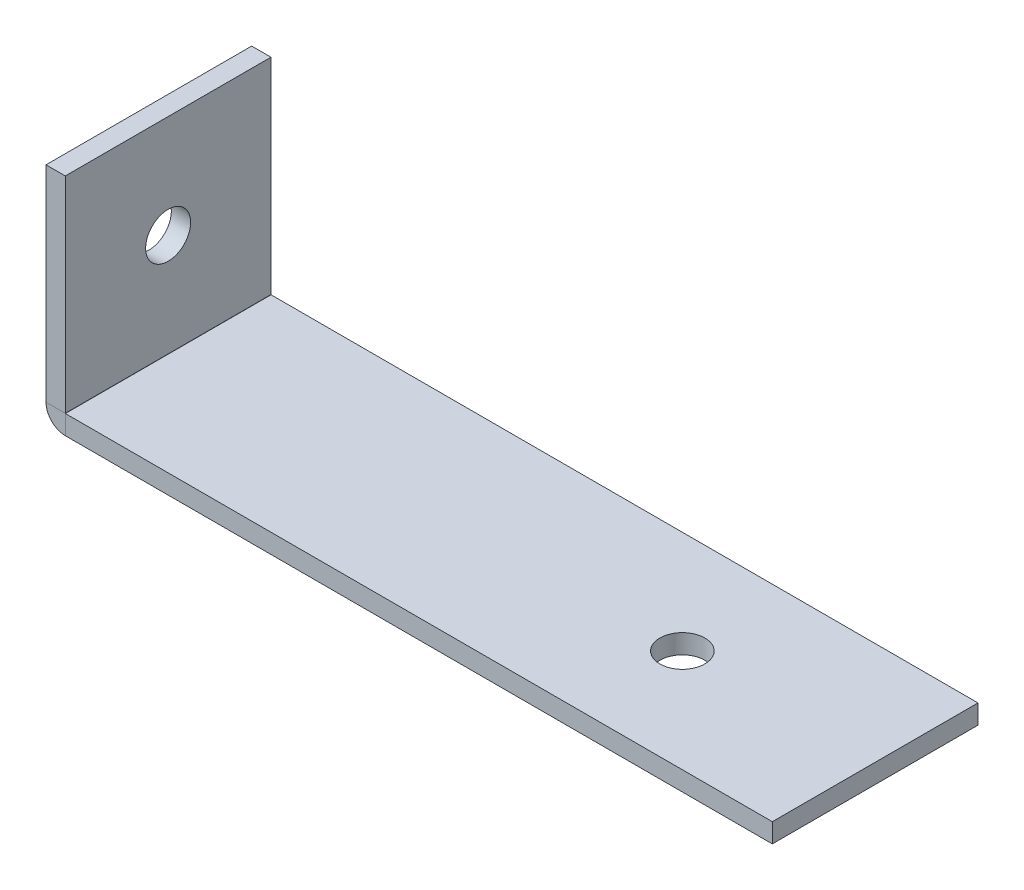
ISO-10303-21;
HEADER;
FILE_DESCRIPTION(('STEP AP214'),'2;1');
FILE_NAME('part.step','',(''),(''),'','','');
FILE_SCHEMA(('AUTOMOTIVE_DESIGN { 1 0 10303 214 1 1 1 1 }'));
ENDSEC;
DATA;
#1=APPLICATION_CONTEXT('core data for automotive mechanical design processes');
#2=APPLICATION_PROTOCOL_DEFINITION('international standard','automotive_design',2000,#1);
#3=PRODUCT_CONTEXT('',#1,'mechanical');
#4=PRODUCT('Part','Part','',(#3));
#5=PRODUCT_RELATED_PRODUCT_CATEGORY('part','',(#4));
#6=PRODUCT_DEFINITION_FORMATION('','',#4);
#7=PRODUCT_DEFINITION_CONTEXT('part definition',#1,'design');
#8=PRODUCT_DEFINITION('design','',#6,#7);
#9=PRODUCT_DEFINITION_SHAPE('','',#8);
#10=(LENGTH_UNIT() NAMED_UNIT(*) SI_UNIT(.MILLI.,.METRE.));
#11=(NAMED_UNIT(*) PLANE_ANGLE_UNIT() SI_UNIT($,.RADIAN.));
#12=(NAMED_UNIT(*) SI_UNIT($,.STERADIAN.) SOLID_ANGLE_UNIT());
#13=UNCERTAINTY_MEASURE_WITH_UNIT(LENGTH_MEASURE(1.E-05),#10,'distance_accuracy_value','');
#14=(GEOMETRIC_REPRESENTATION_CONTEXT(3) GLOBAL_UNCERTAINTY_ASSIGNED_CONTEXT((#13)) GLOBAL_UNIT_ASSIGNED_CONTEXT((#10,
#11,#12)) REPRESENTATION_CONTEXT('',''));
#15=CARTESIAN_POINT('',(0.,0.,0.));
#16=DIRECTION('',(0.,0.,1.));
#17=DIRECTION('',(1.,0.,0.));
#18=AXIS2_PLACEMENT_3D('',#15,#16,#17);
#19=CARTESIAN_POINT('',(14.4978657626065,17.5021342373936,-16.));
#20=DIRECTION('',(-1.,0.,0.));
#21=DIRECTION('',(0.,0.,-1.));
#22=AXIS2_PLACEMENT_3D('',#19,#20,#21);
#23=PLANE('',#22);
#24=CARTESIAN_POINT('',(14.4978657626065,9.50213423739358,-7.99999999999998));
#25=DIRECTION('',(1.,0.,0.));
#26=DIRECTION('',(0.,0.,1.));
#27=AXIS2_PLACEMENT_3D('',#24,#25,#26);
#28=CIRCLE('',#27,1.75);
#29=CARTESIAN_POINT('',(14.4978657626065,9.50213423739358,-6.24999999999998));
#30=VERTEX_POINT('',#29);
#31=EDGE_CURVE('E141',#30,#30,#28,.T.);
#32=ORIENTED_EDGE('',*,*,#31,.T.);
#33=EDGE_LOOP('',(#32));
#34=FACE_BOUND('',#33,.T.);
#35=DIRECTION('',(0.,1.,0.));
#36=VECTOR('',#35,1.);
#37=CARTESIAN_POINT('',(14.4978657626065,17.5021342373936,-16.));
#38=LINE('',#37,#36);
#39=CARTESIAN_POINT('',(14.4978657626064,1.51000000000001,-16.));
#40=VERTEX_POINT('',#39);
#41=CARTESIAN_POINT('',(14.4978657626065,17.5021342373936,-16.));
#42=VERTEX_POINT('',#41);
#43=EDGE_CURVE('E53',#40,#42,#38,.T.);
#44=ORIENTED_EDGE('',*,*,#43,.F.);
#45=DIRECTION('',(0.,0.,1.));
#46=VECTOR('',#45,1.);
#47=CARTESIAN_POINT('',(14.4978657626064,1.51000000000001,-16.));
#48=LINE('',#47,#46);
#49=CARTESIAN_POINT('',(14.4978657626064,1.51000000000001,0.));
#50=VERTEX_POINT('',#49);
#51=EDGE_CURVE('E45',#40,#50,#48,.T.);
#52=ORIENTED_EDGE('',*,*,#51,.T.);
#53=DIRECTION('',(0.,-1.,0.));
#54=VECTOR('',#53,1.);
#55=CARTESIAN_POINT('',(14.4978657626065,17.5021342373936,0.));
#56=LINE('',#55,#54);
#57=CARTESIAN_POINT('',(14.4978657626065,17.5021342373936,0.));
#58=VERTEX_POINT('',#57);
#59=EDGE_CURVE('E61',#58,#50,#56,.T.);
#60=ORIENTED_EDGE('',*,*,#59,.F.);
#61=DIRECTION('',(0.,0.,1.));
#62=VECTOR('',#61,1.);
#63=CARTESIAN_POINT('',(14.4978657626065,17.5021342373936,0.));
#64=LINE('',#63,#62);
#65=EDGE_CURVE('E168',#42,#58,#64,.T.);
#66=ORIENTED_EDGE('',*,*,#65,.F.);
#67=EDGE_LOOP('',(#44,#52,#60,#66));
#68=FACE_BOUND('',#67,.T.);
#69=ADVANCED_FACE('F36',(#34,#68),#23,.T.);
#70=CARTESIAN_POINT('',(15.9978657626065,17.5021342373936,-16.));
#71=DIRECTION('',(-1.,0.,0.));
#72=DIRECTION('',(0.,0.,-1.));
#73=AXIS2_PLACEMENT_3D('',#70,#71,#72);
#74=PLANE('',#73);
#75=DIRECTION('',(0.,0.,1.));
#76=VECTOR('',#75,1.);
#77=CARTESIAN_POINT('',(15.9978657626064,1.51,-16.));
#78=LINE('',#77,#76);
#79=CARTESIAN_POINT('',(15.9978657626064,1.51,-16.));
#80=VERTEX_POINT('',#79);
#81=CARTESIAN_POINT('',(15.9978657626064,1.51,0.));
#82=VERTEX_POINT('',#81);
#83=EDGE_CURVE('E182',#80,#82,#78,.T.);
#84=ORIENTED_EDGE('',*,*,#83,.F.);
#85=DIRECTION('',(0.,1.,0.));
#86=VECTOR('',#85,1.);
#87=CARTESIAN_POINT('',(15.9978657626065,17.5021342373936,-16.));
#88=LINE('',#87,#86);
#89=CARTESIAN_POINT('',(15.9978657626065,17.5021342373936,-16.));
#90=VERTEX_POINT('',#89);
#91=EDGE_CURVE('E40',#80,#90,#88,.T.);
#92=ORIENTED_EDGE('',*,*,#91,.T.);
#93=DIRECTION('',(0.,0.,1.));
#94=VECTOR('',#93,1.);
#95=CARTESIAN_POINT('',(15.9978657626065,17.5021342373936,0.));
#96=LINE('',#95,#94);
#97=CARTESIAN_POINT('',(15.9978657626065,17.5021342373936,0.));
#98=VERTEX_POINT('',#97);
#99=EDGE_CURVE('E171',#90,#98,#96,.T.);
#100=ORIENTED_EDGE('',*,*,#99,.T.);
#101=DIRECTION('',(0.,-1.,0.));
#102=VECTOR('',#101,1.);
#103=CARTESIAN_POINT('',(15.9978657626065,17.5021342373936,0.));
#104=LINE('',#103,#102);
#105=EDGE_CURVE('E174',#98,#82,#104,.T.);
#106=ORIENTED_EDGE('',*,*,#105,.T.);
#107=EDGE_LOOP('',(#84,#92,#100,#106));
#108=FACE_BOUND('',#107,.T.);
#109=CARTESIAN_POINT('',(15.9978657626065,9.50213423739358,-7.99999999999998));
#110=DIRECTION('',(1.,0.,0.));
#111=DIRECTION('',(0.,0.,1.));
#112=AXIS2_PLACEMENT_3D('',#109,#110,#111);
#113=CIRCLE('',#112,1.75);
#114=CARTESIAN_POINT('',(15.9978657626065,9.50213423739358,-6.24999999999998));
#115=VERTEX_POINT('',#114);
#116=EDGE_CURVE('E165',#115,#115,#113,.T.);
#117=ORIENTED_EDGE('',*,*,#116,.F.);
#118=EDGE_LOOP('',(#117));
#119=FACE_BOUND('',#118,.T.);
#120=ADVANCED_FACE('F193',(#108,#119),#74,.F.);
#121=CARTESIAN_POINT('',(15.9978657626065,17.5021342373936,0.));
#122=DIRECTION('',(0.,-1.,0.));
#123=DIRECTION('',(0.,0.,-1.));
#124=AXIS2_PLACEMENT_3D('',#121,#122,#123);
#125=PLANE('',#124);
#126=ORIENTED_EDGE('',*,*,#65,.T.);
#127=DIRECTION('',(-1.,0.,0.));
#128=VECTOR('',#127,1.);
#129=CARTESIAN_POINT('',(15.9978657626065,17.5021342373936,0.));
#130=LINE('',#129,#128);
#131=EDGE_CURVE('E180',#98,#58,#130,.T.);
#132=ORIENTED_EDGE('',*,*,#131,.F.);
#133=ORIENTED_EDGE('',*,*,#99,.F.);
#134=DIRECTION('',(-1.,0.,0.));
#135=VECTOR('',#134,1.);
#136=CARTESIAN_POINT('',(15.9978657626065,17.5021342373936,-16.));
#137=LINE('',#136,#135);
#138=EDGE_CURVE('E177',#90,#42,#137,.T.);
#139=ORIENTED_EDGE('',*,*,#138,.T.);
#140=EDGE_LOOP('',(#126,#132,#133,#139));
#141=FACE_BOUND('',#140,.T.);
#142=ADVANCED_FACE('F199',(#141),#125,.F.);
#143=CARTESIAN_POINT('',(15.9978657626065,17.5021342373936,0.));
#144=DIRECTION('',(0.,0.,-1.));
#145=DIRECTION('',(0.,1.,0.));
#146=AXIS2_PLACEMENT_3D('',#143,#144,#145);
#147=PLANE('',#146);
#148=DIRECTION('',(-1.,0.,0.));
#149=VECTOR('',#148,1.);
#150=CARTESIAN_POINT('',(15.9978657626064,1.51,0.));
#151=LINE('',#150,#149);
#152=EDGE_CURVE('E184',#82,#50,#151,.T.);
#153=ORIENTED_EDGE('',*,*,#152,.F.);
#154=ORIENTED_EDGE('',*,*,#105,.F.);
#155=ORIENTED_EDGE('',*,*,#131,.T.);
#156=ORIENTED_EDGE('',*,*,#59,.T.);
#157=EDGE_LOOP('',(#153,#154,#155,#156));
#158=FACE_BOUND('',#157,.T.);
#159=ADVANCED_FACE('F200',(#158),#147,.F.);
#160=CARTESIAN_POINT('',(15.9978657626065,17.5021342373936,-16.));
#161=DIRECTION('',(0.,0.,1.));
#162=DIRECTION('',(0.,-1.,0.));
#163=AXIS2_PLACEMENT_3D('',#160,#161,#162);
#164=PLANE('',#163);
#165=DIRECTION('',(1.,0.,0.));
#166=VECTOR('',#165,1.);
#167=CARTESIAN_POINT('',(15.9978657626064,1.51,-16.));
#168=LINE('',#167,#166);
#169=EDGE_CURVE('E12',#40,#80,#168,.T.);
#170=ORIENTED_EDGE('',*,*,#169,.F.);
#171=ORIENTED_EDGE('',*,*,#43,.T.);
#172=ORIENTED_EDGE('',*,*,#138,.F.);
#173=ORIENTED_EDGE('',*,*,#91,.F.);
#174=EDGE_LOOP('',(#170,#171,#172,#173));
#175=FACE_BOUND('',#174,.T.);
#176=ADVANCED_FACE('F38',(#175),#164,.F.);
#177=CARTESIAN_POINT('',(15.9978657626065,9.50213423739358,-7.99999999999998));
#178=DIRECTION('',(-1.,0.,0.));
#179=DIRECTION('',(0.,0.,-1.));
#180=AXIS2_PLACEMENT_3D('',#177,#178,#179);
#181=CYLINDRICAL_SURFACE('',#180,1.75);
#182=ORIENTED_EDGE('',*,*,#116,.T.);
#183=EDGE_LOOP('',(#182));
#184=FACE_BOUND('',#183,.T.);
#185=ORIENTED_EDGE('',*,*,#31,.F.);
#186=EDGE_LOOP('',(#185));
#187=FACE_BOUND('',#186,.T.);
#188=ADVANCED_FACE('F223',(#184,#187),#181,.F.);
#189=CARTESIAN_POINT('',(71.,1.5,0.));
#190=DIRECTION('',(-1.,0.,0.));
#191=DIRECTION('',(0.,0.,1.));
#192=AXIS2_PLACEMENT_3D('',#189,#190,#191);
#193=PLANE('',#192);
#194=DIRECTION('',(0.,0.,-1.));
#195=VECTOR('',#194,1.);
#196=CARTESIAN_POINT('',(71.,0.,0.));
#197=LINE('',#196,#195);
#198=CARTESIAN_POINT('',(71.,0.,0.));
#199=VERTEX_POINT('',#198);
#200=CARTESIAN_POINT('',(71.,0.,-16.));
#201=VERTEX_POINT('',#200);
#202=EDGE_CURVE('E161',#199,#201,#197,.T.);
#203=ORIENTED_EDGE('',*,*,#202,.T.);
#204=DIRECTION('',(0.,-1.,0.));
#205=VECTOR('',#204,1.);
#206=CARTESIAN_POINT('',(71.,1.5,-16.));
#207=LINE('',#206,#205);
#208=CARTESIAN_POINT('',(71.,1.5,-16.));
#209=VERTEX_POINT('',#208);
#210=EDGE_CURVE('E139',#209,#201,#207,.T.);
#211=ORIENTED_EDGE('',*,*,#210,.F.);
#212=DIRECTION('',(0.,0.,-1.));
#213=VECTOR('',#212,1.);
#214=CARTESIAN_POINT('',(71.,1.5,0.));
#215=LINE('',#214,#213);
#216=CARTESIAN_POINT('',(71.,1.5,0.));
#217=VERTEX_POINT('',#216);
#218=EDGE_CURVE('E128',#217,#209,#215,.T.);
#219=ORIENTED_EDGE('',*,*,#218,.F.);
#220=DIRECTION('',(0.,-1.,0.));
#221=VECTOR('',#220,1.);
#222=CARTESIAN_POINT('',(71.,1.5,0.));
#223=LINE('',#222,#221);
#224=EDGE_CURVE('E158',#217,#199,#223,.T.);
#225=ORIENTED_EDGE('',*,*,#224,.T.);
#226=EDGE_LOOP('',(#203,#211,#219,#225));
#227=FACE_BOUND('',#226,.T.);
#228=ADVANCED_FACE('F220',(#227),#193,.F.);
#229=CARTESIAN_POINT('',(56.,1.5,-7.99999999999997));
#230=DIRECTION('',(0.,-1.,0.));
#231=DIRECTION('',(0.,0.,-1.));
#232=AXIS2_PLACEMENT_3D('',#229,#230,#231);
#233=CYLINDRICAL_SURFACE('',#232,1.75);
#234=CARTESIAN_POINT('',(56.,1.5,-7.99999999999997));
#235=DIRECTION('',(0.,1.,0.));
#236=DIRECTION('',(0.,0.,1.));
#237=AXIS2_PLACEMENT_3D('',#234,#235,#236);
#238=CIRCLE('',#237,1.75);
#239=CARTESIAN_POINT('',(56.,1.5,-6.24999999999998));
#240=VERTEX_POINT('',#239);
#241=EDGE_CURVE('E132',#240,#240,#238,.T.);
#242=ORIENTED_EDGE('',*,*,#241,.T.);
#243=EDGE_LOOP('',(#242));
#244=FACE_BOUND('',#243,.T.);
#245=CARTESIAN_POINT('',(56.,0.,-7.99999999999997));
#246=DIRECTION('',(0.,1.,0.));
#247=DIRECTION('',(0.,0.,1.));
#248=AXIS2_PLACEMENT_3D('',#245,#246,#247);
#249=CIRCLE('',#248,1.75);
#250=CARTESIAN_POINT('',(56.,0.,-6.24999999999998));
#251=VERTEX_POINT('',#250);
#252=EDGE_CURVE('E143',#251,#251,#249,.T.);
#253=ORIENTED_EDGE('',*,*,#252,.F.);
#254=EDGE_LOOP('',(#253));
#255=FACE_BOUND('',#254,.T.);
#256=ADVANCED_FACE('F222',(#244,#255),#233,.F.);
#257=CARTESIAN_POINT('',(0.,1.5,-16.));
#258=DIRECTION('',(0.,-1.,0.));
#259=DIRECTION('',(0.,0.,-1.));
#260=AXIS2_PLACEMENT_3D('',#257,#258,#259);
#261=PLANE('',#260);
#262=ORIENTED_EDGE('',*,*,#241,.F.);
#263=EDGE_LOOP('',(#262));
#264=FACE_BOUND('',#263,.T.);
#265=DIRECTION('',(-1.,0.,0.));
#266=VECTOR('',#265,1.);
#267=CARTESIAN_POINT('',(0.,1.5,-16.));
#268=LINE('',#267,#266);
#269=CARTESIAN_POINT('',(16.0078657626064,1.5,-16.));
#270=VERTEX_POINT('',#269);
#271=EDGE_CURVE('E123',#209,#270,#268,.T.);
#272=ORIENTED_EDGE('',*,*,#271,.T.);
#273=DIRECTION('',(0.,0.,1.));
#274=VECTOR('',#273,1.);
#275=CARTESIAN_POINT('',(16.0078657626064,1.5,-16.));
#276=LINE('',#275,#274);
#277=CARTESIAN_POINT('',(16.0078657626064,1.5,0.));
#278=VERTEX_POINT('',#277);
#279=EDGE_CURVE('E116',#270,#278,#276,.T.);
#280=ORIENTED_EDGE('',*,*,#279,.T.);
#281=DIRECTION('',(1.,0.,0.));
#282=VECTOR('',#281,1.);
#283=CARTESIAN_POINT('',(0.,1.5,0.));
#284=LINE('',#283,#282);
#285=EDGE_CURVE('E122',#278,#217,#284,.T.);
#286=ORIENTED_EDGE('',*,*,#285,.T.);
#287=ORIENTED_EDGE('',*,*,#218,.T.);
#288=EDGE_LOOP('',(#272,#280,#286,#287));
#289=FACE_BOUND('',#288,.T.);
#290=ADVANCED_FACE('F126',(#264,#289),#261,.F.);
#291=CARTESIAN_POINT('',(0.,1.5,0.));
#292=DIRECTION('',(0.,0.,-1.));
#293=DIRECTION('',(-1.,0.,0.));
#294=AXIS2_PLACEMENT_3D('',#291,#292,#293);
#295=PLANE('',#294);
#296=ORIENTED_EDGE('',*,*,#285,.F.);
#297=DIRECTION('',(0.,-1.,0.));
#298=VECTOR('',#297,1.);
#299=CARTESIAN_POINT('',(16.0078657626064,1.5,0.));
#300=LINE('',#299,#298);
#301=CARTESIAN_POINT('',(16.0078657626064,0.,0.));
#302=VERTEX_POINT('',#301);
#303=EDGE_CURVE('E151',#278,#302,#300,.T.);
#304=ORIENTED_EDGE('',*,*,#303,.T.);
#305=DIRECTION('',(1.,0.,0.));
#306=VECTOR('',#305,1.);
#307=CARTESIAN_POINT('',(0.,0.,0.));
#308=LINE('',#307,#306);
#309=EDGE_CURVE('E149',#302,#199,#308,.T.);
#310=ORIENTED_EDGE('',*,*,#309,.T.);
#311=ORIENTED_EDGE('',*,*,#224,.F.);
#312=EDGE_LOOP('',(#296,#304,#310,#311));
#313=FACE_BOUND('',#312,.T.);
#314=ADVANCED_FACE('F218',(#313),#295,.F.);
#315=CARTESIAN_POINT('',(0.,0.,-16.));
#316=DIRECTION('',(0.,-1.,0.));
#317=DIRECTION('',(0.,0.,-1.));
#318=AXIS2_PLACEMENT_3D('',#315,#316,#317);
#319=PLANE('',#318);
#320=DIRECTION('',(0.,0.,1.));
#321=VECTOR('',#320,1.);
#322=CARTESIAN_POINT('',(16.0078657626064,0.,-16.));
#323=LINE('',#322,#321);
#324=CARTESIAN_POINT('',(16.0078657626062,0.,-16.));
#325=VERTEX_POINT('',#324);
#326=EDGE_CURVE('E163',#325,#302,#323,.T.);
#327=ORIENTED_EDGE('',*,*,#326,.F.);
#328=DIRECTION('',(-1.,0.,0.));
#329=VECTOR('',#328,1.);
#330=CARTESIAN_POINT('',(0.,0.,-16.));
#331=LINE('',#330,#329);
#332=EDGE_CURVE('E137',#201,#325,#331,.T.);
#333=ORIENTED_EDGE('',*,*,#332,.F.);
#334=ORIENTED_EDGE('',*,*,#202,.F.);
#335=ORIENTED_EDGE('',*,*,#309,.F.);
#336=EDGE_LOOP('',(#327,#333,#334,#335));
#337=FACE_BOUND('',#336,.T.);
#338=ORIENTED_EDGE('',*,*,#252,.T.);
#339=EDGE_LOOP('',(#338));
#340=FACE_BOUND('',#339,.T.);
#341=ADVANCED_FACE('F213',(#337,#340),#319,.T.);
#342=CARTESIAN_POINT('',(0.,1.5,-16.));
#343=DIRECTION('',(0.,0.,1.));
#344=DIRECTION('',(1.,0.,0.));
#345=AXIS2_PLACEMENT_3D('',#342,#343,#344);
#346=PLANE('',#345);
#347=ORIENTED_EDGE('',*,*,#332,.T.);
#348=DIRECTION('',(0.,1.,0.));
#349=VECTOR('',#348,1.);
#350=CARTESIAN_POINT('',(16.0078657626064,1.5,-16.));
#351=LINE('',#350,#349);
#352=EDGE_CURVE('E107',#325,#270,#351,.T.);
#353=ORIENTED_EDGE('',*,*,#352,.T.);
#354=ORIENTED_EDGE('',*,*,#271,.F.);
#355=ORIENTED_EDGE('',*,*,#210,.T.);
#356=EDGE_LOOP('',(#347,#353,#354,#355));
#357=FACE_BOUND('',#356,.T.);
#358=ADVANCED_FACE('F135',(#357),#346,.F.);
#359=CARTESIAN_POINT('',(16.0078657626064,1.51,-16.));
#360=DIRECTION('',(0.,0.,1.));
#361=DIRECTION('',(1.,0.,0.));
#362=AXIS2_PLACEMENT_3D('',#359,#360,#361);
#363=PLANE('',#362);
#364=ORIENTED_EDGE('',*,*,#352,.F.);
#365=CARTESIAN_POINT('',(16.0078657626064,1.51,-16.));
#366=DIRECTION('',(0.,0.,1.));
#367=DIRECTION('',(1.,0.,0.));
#368=AXIS2_PLACEMENT_3D('',#365,#366,#367);
#369=CIRCLE('',#368,1.51);
#370=EDGE_CURVE('E209',#325,#40,#369,.F.);
#371=ORIENTED_EDGE('',*,*,#370,.T.);
#372=ORIENTED_EDGE('',*,*,#169,.T.);
#373=CARTESIAN_POINT('',(16.0078657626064,1.51,-16.));
#374=DIRECTION('',(0.,0.,-1.));
#375=DIRECTION('',(-1.,0.,0.));
#376=AXIS2_PLACEMENT_3D('',#373,#374,#375);
#377=CIRCLE('',#376,0.00999999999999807);
#378=EDGE_CURVE('E102',#270,#80,#377,.T.);
#379=ORIENTED_EDGE('',*,*,#378,.F.);
#380=EDGE_LOOP('',(#364,#371,#372,#379));
#381=FACE_BOUND('',#380,.T.);
#382=ADVANCED_FACE('F104',(#381),#363,.F.);
#383=CARTESIAN_POINT('',(16.0078657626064,1.51,0.));
#384=DIRECTION('',(0.,0.,-1.));
#385=DIRECTION('',(-1.,0.,0.));
#386=AXIS2_PLACEMENT_3D('',#383,#384,#385);
#387=PLANE('',#386);
#388=ORIENTED_EDGE('',*,*,#152,.T.);
#389=CARTESIAN_POINT('',(16.0078657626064,1.51,0.));
#390=DIRECTION('',(0.,0.,1.));
#391=DIRECTION('',(1.,0.,0.));
#392=AXIS2_PLACEMENT_3D('',#389,#390,#391);
#393=CIRCLE('',#392,1.51);
#394=EDGE_CURVE('E112',#50,#302,#393,.T.);
#395=ORIENTED_EDGE('',*,*,#394,.T.);
#396=ORIENTED_EDGE('',*,*,#303,.F.);
#397=CARTESIAN_POINT('',(16.0078657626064,1.51,0.));
#398=DIRECTION('',(0.,0.,1.));
#399=DIRECTION('',(1.,0.,0.));
#400=AXIS2_PLACEMENT_3D('',#397,#398,#399);
#401=CIRCLE('',#400,0.00999999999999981);
#402=EDGE_CURVE('E111',#82,#278,#401,.T.);
#403=ORIENTED_EDGE('',*,*,#402,.F.);
#404=EDGE_LOOP('',(#388,#395,#396,#403));
#405=FACE_BOUND('',#404,.T.);
#406=ADVANCED_FACE('F204',(#405),#387,.F.);
#407=CARTESIAN_POINT('',(16.0078657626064,1.51,-24.0701663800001));
#408=DIRECTION('',(0.,0.,1.));
#409=DIRECTION('',(1.,0.,0.));
#410=AXIS2_PLACEMENT_3D('',#407,#408,#409);
#411=CYLINDRICAL_SURFACE('',#410,0.01);
#412=ORIENTED_EDGE('',*,*,#402,.T.);
#413=ORIENTED_EDGE('',*,*,#279,.F.);
#414=ORIENTED_EDGE('',*,*,#378,.T.);
#415=ORIENTED_EDGE('',*,*,#83,.T.);
#416=EDGE_LOOP('',(#412,#413,#414,#415));
#417=FACE_BOUND('',#416,.T.);
#418=ADVANCED_FACE('F118',(#417),#411,.F.);
#419=CARTESIAN_POINT('',(16.0078657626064,1.51,-24.0701663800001));
#420=DIRECTION('',(0.,0.,1.));
#421=DIRECTION('',(1.,0.,0.));
#422=AXIS2_PLACEMENT_3D('',#419,#420,#421);
#423=CYLINDRICAL_SURFACE('',#422,1.51);
#424=ORIENTED_EDGE('',*,*,#394,.F.);
#425=ORIENTED_EDGE('',*,*,#51,.F.);
#426=ORIENTED_EDGE('',*,*,#370,.F.);
#427=ORIENTED_EDGE('',*,*,#326,.T.);
#428=EDGE_LOOP('',(#424,#425,#426,#427));
#429=FACE_BOUND('',#428,.T.);
#430=ADVANCED_FACE('F208',(#429),#423,.T.);
#431=CLOSED_SHELL('',(#69,#120,#142,#159,#176,#188,#228,#256,#290,#314,#341,#358,#382,#406,#418,#430));
#432=MANIFOLD_SOLID_BREP('B2',#431);
#433=ADVANCED_BREP_SHAPE_REPRESENTATION('',(#18,#432),#14);
#434=SHAPE_DEFINITION_REPRESENTATION(#9,#433);
ENDSEC;
END-ISO-10303-21;
